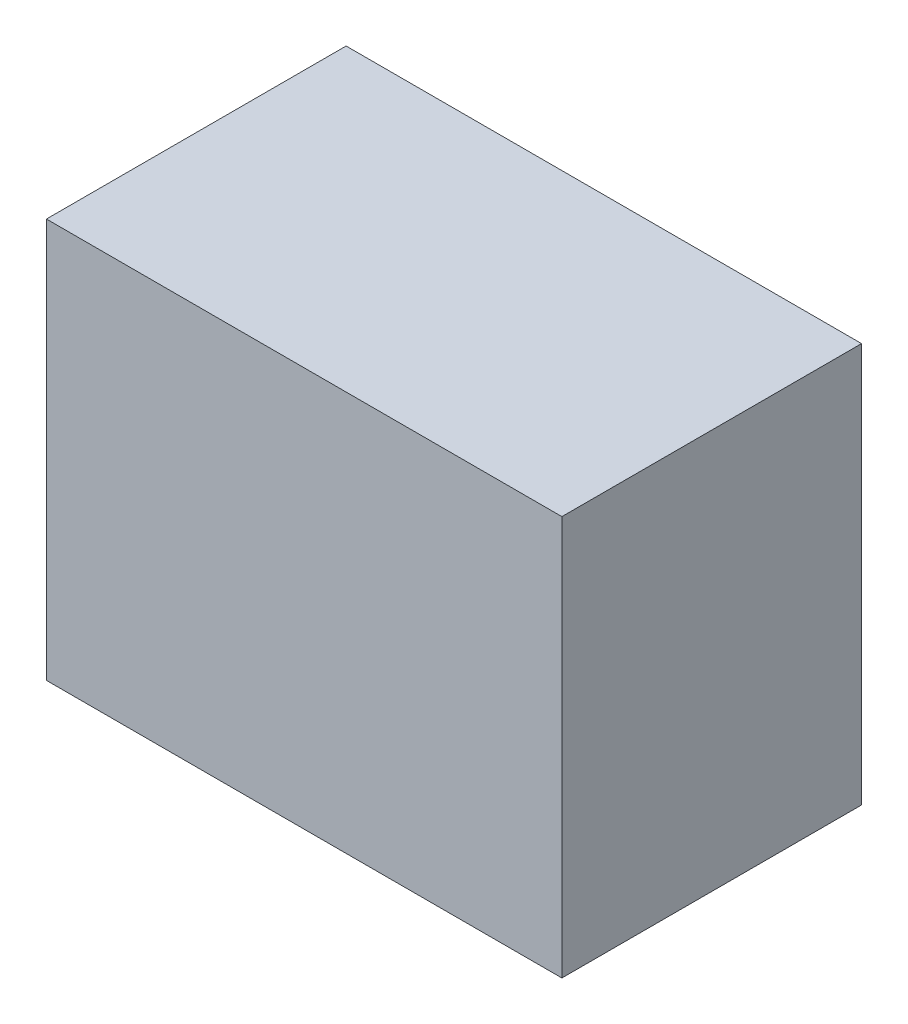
from build123d import *

# Parameters (mm, degrees)
SKETCH2_W           = 25.8
SKETCH2_H           = 15
BOSS_EXTRUDE1_DEPTH = 20


with BuildPart() as part:
    # Sketch2 → Boss-Extrude1 (new body)
    with BuildSketch(Plane(origin=(0, 0, 0), x_dir=(1, 0, 0), z_dir=(0, 1, 0))):
        with Locations((12.9, 7.5)):
            Rectangle(SKETCH2_W, SKETCH2_H)
    extrude(amount=BOSS_EXTRUDE1_DEPTH)


solid = part.part
